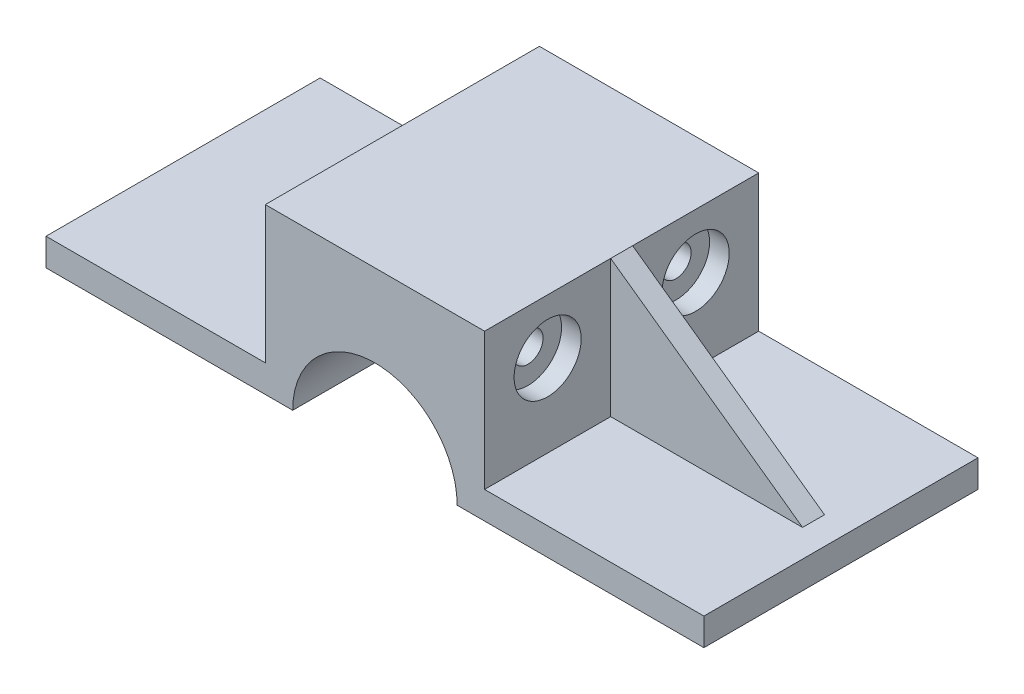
from build123d import *

# Parameters (mm, degrees)
EXTRUDE1_DEPTH                          = 25
RIB_REACH                               = 73.589
SKETCH4_WALL_W                          = 188.189836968
SKETCH4_WALL_H                          = 4
CBORE_FOR_M5_HEX_HEAD_BOLT3_D           = 5.5
CBORE_FOR_M5_HEX_HEAD_BOLT3_DEPTH       = 10
CBORE_FOR_M5_HEX_HEAD_BOLT3_CBORE_D     = 12.24
CBORE_FOR_M5_HEX_HEAD_BOLT3_CBORE_DEPTH = 3.58
CBORE_FOR_M5_HEX_HEAD_BOLT3_TIP         = 1.652366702


with BuildPart() as part:
    # Sketch1 → Extrude1 (new, symmetric)
    with BuildSketch(Plane.XY):
        with BuildLine():
            Line((-60, 0), (-15, 0))
            ThreePointArc((-15, 0), (0, 15), (15, 0))
            Line((15, 0), (60, 0))
            Line((60, 0), (60, 5))
            Line((60, 5), (20, 5))
            Line((20, 5), (20, 30))
            Line((20, 30), (-20, 30))
            Line((-20, 30), (-20, 5))
            Line((-20, 5), (-60, 5))
            Line((-60, 5), (-60, 0))
        make_face()
    extrude(amount=EXTRUDE1_DEPTH, both=True)

    # Sketch4 wall → Rib (add, up to next)
    with BuildSketch(Plane(origin=(37.5, 17.5, 0), x_dir=(0.813733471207, -0.581238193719, 0), z_dir=(0.581238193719, 0.813733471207, 0)), mode=Mode.PRIVATE) as rib_sk1:
        Rectangle(SKETCH4_WALL_W, SKETCH4_WALL_H)
    rib_tool1 = extrude(rib_sk1.sketch, amount=-RIB_REACH, mode=Mode.PRIVATE) - part.part
    add(rib_tool1.solids().sort_by_distance((37.5, 17.5, 0))[0])

    # CBORE for M5 Hex Head Bolt3
    with Locations(Plane(origin=(20, 0, 0), x_dir=(0, 0, -1), z_dir=(1, 0, 0))):
        with Locations((-13.5, 20), (13.5, 20)):
            CounterBoreHole(CBORE_FOR_M5_HEX_HEAD_BOLT3_D / 2, CBORE_FOR_M5_HEX_HEAD_BOLT3_CBORE_D / 2, CBORE_FOR_M5_HEX_HEAD_BOLT3_CBORE_DEPTH, depth=CBORE_FOR_M5_HEX_HEAD_BOLT3_DEPTH)
            with Locations((0, 0, -(CBORE_FOR_M5_HEX_HEAD_BOLT3_DEPTH + CBORE_FOR_M5_HEX_HEAD_BOLT3_TIP / 2))):  # 118° drill point
                Cone(0, CBORE_FOR_M5_HEX_HEAD_BOLT3_D / 2, CBORE_FOR_M5_HEX_HEAD_BOLT3_TIP, mode=Mode.SUBTRACT)


solid = part.part
